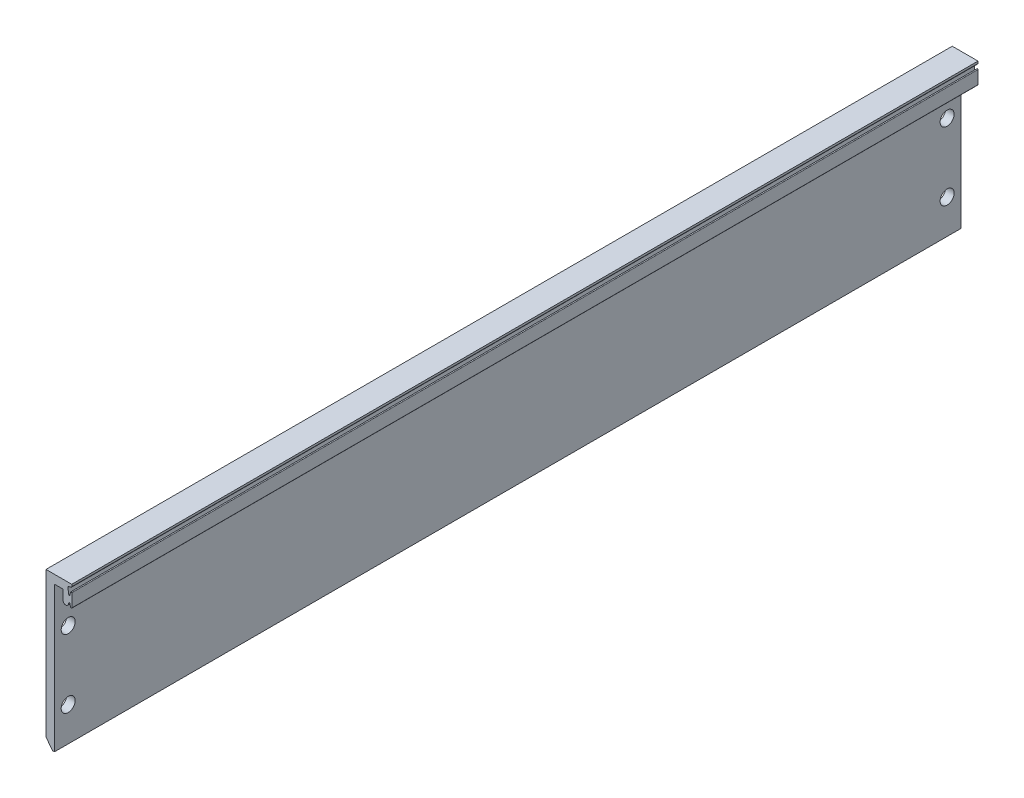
from build123d import *

# Parameters (mm, degrees)
EXTRUDE_1_DEPTH     = 132.675
SKETCH_2_R          = 2.05
CUT_EXTRUDE_1_DEPTH = 3109.64314778


with BuildPart() as part:
    # Sketch 1 → Extrude 1 (new, symmetric)
    with BuildSketch(Plane.XY):
        with BuildLine():
            Line((2261.939900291, -3061.761167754), (2262.488979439, -3061.672269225))
            ThreePointArc((2262.488979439, -3061.672269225), (2262.669488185, -3061.570568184), (2262.741032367, -3061.376125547))
            Line((2262.741032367, -3061.376125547), (2262.741032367, -3060.801460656))
            Line((2262.741032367, -3060.801460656), (2255.201032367, -3060.801460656))
            Line((2255.201032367, -3060.801460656), (2255.201032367, -3103.301460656))
            Line((2255.201032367, -3103.301460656), (2257.101032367, -3105.801460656))
            Line((2257.101032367, -3105.801460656), (2257.701032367, -3105.801460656))
            Line((2257.701032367, -3105.801460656), (2257.701032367, -3063.301460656))
            Line((2257.701032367, -3063.301460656), (2260.201032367, -3063.301460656))
            Line((2260.201032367, -3063.301460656), (2260.201032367, -3066.167750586))
            ThreePointArc((2260.201032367, -3066.167750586), (2260.881368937, -3066.944613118), (2261.741182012, -3066.372691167))
            Line((2261.741182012, -3066.372691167), (2261.886251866, -3065.83723558))
            ThreePointArc((2261.886251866, -3065.83723558), (2262.032698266, -3065.726469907), (2262.176648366, -3065.84046092))
            Line((2262.176648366, -3065.84046092), (2262.420781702, -3066.82796037))
            ThreePointArc((2262.420781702, -3066.82796037), (2262.598176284, -3066.950268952), (2262.741032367, -3066.788960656))
            Line((2262.741032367, -3066.788960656), (2262.741032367, -3062.963960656))
            ThreePointArc((2262.741032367, -3062.963960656), (2262.598176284, -3062.802652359), (2262.420781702, -3062.924960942))
            Line((2262.420781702, -3062.924960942), (2262.176648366, -3063.912460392))
            ThreePointArc((2262.176648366, -3063.912460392), (2262.021628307, -3064.026165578), (2261.882056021, -3063.893954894))
            ThreePointArc((2261.882056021, -3063.893954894), (2261.718086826, -3062.976641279), (2261.688089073, -3062.045271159))
            ThreePointArc((2261.688089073, -3062.045271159), (2261.763340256, -3061.85832259), (2261.939900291, -3061.761167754))
        make_face()
    extrude(amount=EXTRUDE_1_DEPTH, both=True)

    # Sketch 2 → Cut-Extrude 1 (cut, through all)
    with BuildSketch(Plane.ZY.offset(-2255.201032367)):
        with Locations(Location((-128.675, -3075.801460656, 0), (0, 0, 270))):
            Circle(SKETCH_2_R)
        with Locations(Location((-128.675, -3095.801460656, 0), (0, 0, 270))):
            Circle(SKETCH_2_R)
        with Locations(Location((128.675, -3095.801460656, 0), (0, 0, 270))):
            Circle(SKETCH_2_R)
        with Locations(Location((128.675, -3075.801460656, 0), (0, 0, 270))):
            Circle(SKETCH_2_R)
    extrude(amount=-CUT_EXTRUDE_1_DEPTH, mode=Mode.SUBTRACT)


solid = part.part
